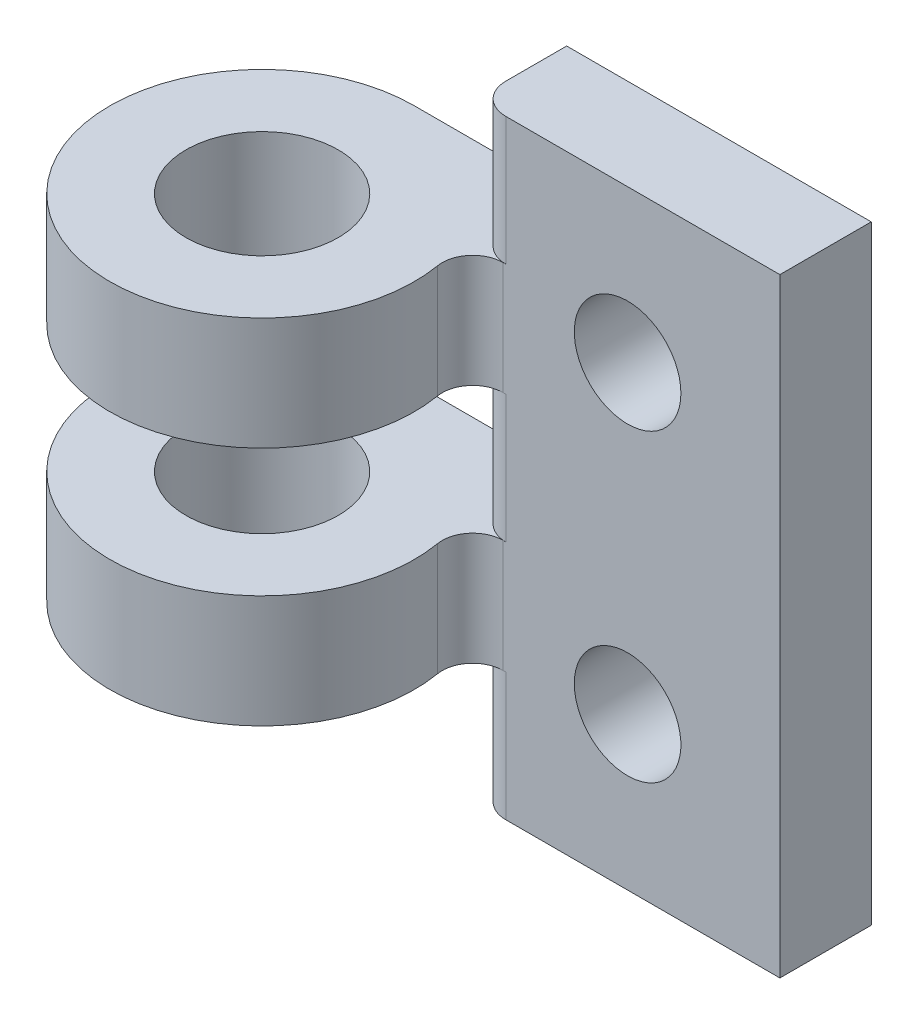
ISO-10303-21;
HEADER;
FILE_DESCRIPTION(('STEP AP214'),'2;1');
FILE_NAME('part.step','',(''),(''),'','','');
FILE_SCHEMA(('AUTOMOTIVE_DESIGN { 1 0 10303 214 1 1 1 1 }'));
ENDSEC;
DATA;
#1=APPLICATION_CONTEXT('core data for automotive mechanical design processes');
#2=APPLICATION_PROTOCOL_DEFINITION('international standard','automotive_design',2000,#1);
#3=PRODUCT_CONTEXT('',#1,'mechanical');
#4=PRODUCT('Part','Part','',(#3));
#5=PRODUCT_RELATED_PRODUCT_CATEGORY('part','',(#4));
#6=PRODUCT_DEFINITION_FORMATION('','',#4);
#7=PRODUCT_DEFINITION_CONTEXT('part definition',#1,'design');
#8=PRODUCT_DEFINITION('design','',#6,#7);
#9=PRODUCT_DEFINITION_SHAPE('','',#8);
#10=(LENGTH_UNIT() NAMED_UNIT(*) SI_UNIT(.MILLI.,.METRE.));
#11=(NAMED_UNIT(*) PLANE_ANGLE_UNIT() SI_UNIT($,.RADIAN.));
#12=(NAMED_UNIT(*) SI_UNIT($,.STERADIAN.) SOLID_ANGLE_UNIT());
#13=UNCERTAINTY_MEASURE_WITH_UNIT(LENGTH_MEASURE(1.E-05),#10,'distance_accuracy_value','');
#14=(GEOMETRIC_REPRESENTATION_CONTEXT(3) GLOBAL_UNCERTAINTY_ASSIGNED_CONTEXT((#13)) GLOBAL_UNIT_ASSIGNED_CONTEXT((#10,
#11,#12)) REPRESENTATION_CONTEXT('',''));
#15=CARTESIAN_POINT('',(0.,0.,0.));
#16=DIRECTION('',(0.,0.,1.));
#17=DIRECTION('',(1.,0.,0.));
#18=AXIS2_PLACEMENT_3D('',#15,#16,#17);
#19=CARTESIAN_POINT('',(-10.,10.,3.5));
#20=DIRECTION('',(0.,-1.,0.));
#21=DIRECTION('',(0.,0.,-1.));
#22=AXIS2_PLACEMENT_3D('',#19,#20,#21);
#23=CYLINDRICAL_SURFACE('',#22,5.);
#24=CARTESIAN_POINT('',(-10.,2.1,3.5));
#25=DIRECTION('',(0.,1.,0.));
#26=DIRECTION('',(0.,0.,1.));
#27=AXIS2_PLACEMENT_3D('',#24,#25,#26);
#28=CIRCLE('',#27,5.);
#29=CARTESIAN_POINT('',(-10.,2.1,-1.5));
#30=VERTEX_POINT('',#29);
#31=CARTESIAN_POINT('',(-5.06993351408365,2.1,2.66666666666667));
#32=VERTEX_POINT('',#31);
#33=EDGE_CURVE('E242',#30,#32,#28,.T.);
#34=ORIENTED_EDGE('',*,*,#33,.T.);
#35=DIRECTION('',(0.,-1.,0.));
#36=VECTOR('',#35,1.);
#37=CARTESIAN_POINT('',(-5.06993351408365,10.,2.66666666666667));
#38=LINE('',#37,#36);
#39=CARTESIAN_POINT('',(-5.06993351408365,5.80000000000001,2.66666666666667));
#40=VERTEX_POINT('',#39);
#41=EDGE_CURVE('E58',#32,#40,#38,.F.);
#42=ORIENTED_EDGE('',*,*,#41,.T.);
#43=CARTESIAN_POINT('',(-10.,5.80000000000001,3.5));
#44=DIRECTION('',(0.,-1.,0.));
#45=DIRECTION('',(1.,0.,0.));
#46=AXIS2_PLACEMENT_3D('',#43,#44,#45);
#47=CIRCLE('',#46,5.);
#48=CARTESIAN_POINT('',(-10.,5.80000000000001,-1.5));
#49=VERTEX_POINT('',#48);
#50=EDGE_CURVE('E244',#40,#49,#47,.T.);
#51=ORIENTED_EDGE('',*,*,#50,.T.);
#52=DIRECTION('',(0.,-1.,0.));
#53=VECTOR('',#52,1.);
#54=CARTESIAN_POINT('',(-10.,10.,-1.5));
#55=LINE('',#54,#53);
#56=EDGE_CURVE('E205',#49,#30,#55,.T.);
#57=ORIENTED_EDGE('',*,*,#56,.T.);
#58=EDGE_LOOP('',(#34,#42,#51,#57));
#59=FACE_BOUND('',#58,.T.);
#60=ADVANCED_FACE('F37',(#59),#23,.T.);
#61=CARTESIAN_POINT('',(0.,0.,1.5));
#62=DIRECTION('',(0.,0.,-1.));
#63=DIRECTION('',(-1.,0.,0.));
#64=AXIS2_PLACEMENT_3D('',#61,#62,#63);
#65=PLANE('',#64);
#66=DIRECTION('',(-1.,0.,0.));
#67=VECTOR('',#66,1.);
#68=CARTESIAN_POINT('',(0.,-2.1,1.5));
#69=LINE('',#68,#67);
#70=CARTESIAN_POINT('',(-4.,-2.1,1.5));
#71=VERTEX_POINT('',#70);
#72=CARTESIAN_POINT('',(-4.08392021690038,-2.1,1.5));
#73=VERTEX_POINT('',#72);
#74=EDGE_CURVE('E182',#71,#73,#69,.T.);
#75=ORIENTED_EDGE('',*,*,#74,.T.);
#76=DIRECTION('',(0.,1.,0.));
#77=VECTOR('',#76,1.);
#78=CARTESIAN_POINT('',(-4.08392021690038,-5.80000000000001,1.5));
#79=LINE('',#78,#77);
#80=CARTESIAN_POINT('',(-4.08392021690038,-5.80000000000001,1.5));
#81=VERTEX_POINT('',#80);
#82=EDGE_CURVE('E285',#73,#81,#79,.F.);
#83=ORIENTED_EDGE('',*,*,#82,.T.);
#84=DIRECTION('',(1.,0.,0.));
#85=VECTOR('',#84,1.);
#86=CARTESIAN_POINT('',(0.,-5.80000000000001,1.5));
#87=LINE('',#86,#85);
#88=CARTESIAN_POINT('',(-4.,-5.80000000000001,1.5));
#89=VERTEX_POINT('',#88);
#90=EDGE_CURVE('E202',#81,#89,#87,.T.);
#91=ORIENTED_EDGE('',*,*,#90,.T.);
#92=DIRECTION('',(0.,-1.,0.));
#93=VECTOR('',#92,1.);
#94=CARTESIAN_POINT('',(-3.99999999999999,0.,1.5));
#95=LINE('',#94,#93);
#96=CARTESIAN_POINT('',(-4.,-10.,1.5));
#97=VERTEX_POINT('',#96);
#98=EDGE_CURVE('E260',#89,#97,#95,.T.);
#99=ORIENTED_EDGE('',*,*,#98,.T.);
#100=DIRECTION('',(1.,0.,0.));
#101=VECTOR('',#100,1.);
#102=CARTESIAN_POINT('',(-5.,-10.,1.5));
#103=LINE('',#102,#101);
#104=CARTESIAN_POINT('',(5.,-10.,1.5));
#105=VERTEX_POINT('',#104);
#106=EDGE_CURVE('E226',#97,#105,#103,.T.);
#107=ORIENTED_EDGE('',*,*,#106,.T.);
#108=DIRECTION('',(0.,1.,0.));
#109=VECTOR('',#108,1.);
#110=CARTESIAN_POINT('',(5.,-10.,1.5));
#111=LINE('',#110,#109);
#112=CARTESIAN_POINT('',(5.,10.,1.5));
#113=VERTEX_POINT('',#112);
#114=EDGE_CURVE('E219',#105,#113,#111,.T.);
#115=ORIENTED_EDGE('',*,*,#114,.T.);
#116=DIRECTION('',(-1.,0.,0.));
#117=VECTOR('',#116,1.);
#118=CARTESIAN_POINT('',(-5.,10.,1.5));
#119=LINE('',#118,#117);
#120=CARTESIAN_POINT('',(-4.,10.,1.5));
#121=VERTEX_POINT('',#120);
#122=EDGE_CURVE('E222',#113,#121,#119,.T.);
#123=ORIENTED_EDGE('',*,*,#122,.T.);
#124=DIRECTION('',(0.,-1.,0.));
#125=VECTOR('',#124,1.);
#126=CARTESIAN_POINT('',(-3.99999999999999,0.,1.5));
#127=LINE('',#126,#125);
#128=CARTESIAN_POINT('',(-4.,5.80000000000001,1.5));
#129=VERTEX_POINT('',#128);
#130=EDGE_CURVE('E249',#121,#129,#127,.T.);
#131=ORIENTED_EDGE('',*,*,#130,.T.);
#132=DIRECTION('',(-1.,0.,0.));
#133=VECTOR('',#132,1.);
#134=CARTESIAN_POINT('',(0.,5.80000000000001,1.5));
#135=LINE('',#134,#133);
#136=CARTESIAN_POINT('',(-4.08392021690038,5.80000000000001,1.5));
#137=VERTEX_POINT('',#136);
#138=EDGE_CURVE('E190',#129,#137,#135,.T.);
#139=ORIENTED_EDGE('',*,*,#138,.T.);
#140=DIRECTION('',(0.,1.,0.));
#141=VECTOR('',#140,1.);
#142=CARTESIAN_POINT('',(-4.08392021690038,2.1,1.5));
#143=LINE('',#142,#141);
#144=CARTESIAN_POINT('',(-4.08392021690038,2.1,1.5));
#145=VERTEX_POINT('',#144);
#146=EDGE_CURVE('E282',#137,#145,#143,.F.);
#147=ORIENTED_EDGE('',*,*,#146,.T.);
#148=DIRECTION('',(1.,0.,0.));
#149=VECTOR('',#148,1.);
#150=CARTESIAN_POINT('',(0.,2.1,1.5));
#151=LINE('',#150,#149);
#152=CARTESIAN_POINT('',(-4.,2.1,1.5));
#153=VERTEX_POINT('',#152);
#154=EDGE_CURVE('E188',#145,#153,#151,.T.);
#155=ORIENTED_EDGE('',*,*,#154,.T.);
#156=DIRECTION('',(0.,-1.,0.));
#157=VECTOR('',#156,1.);
#158=CARTESIAN_POINT('',(-4.,0.,1.5));
#159=LINE('',#158,#157);
#160=EDGE_CURVE('E257',#153,#71,#159,.T.);
#161=ORIENTED_EDGE('',*,*,#160,.T.);
#162=EDGE_LOOP('',(#75,#83,#91,#99,#107,#115,#123,#131,#139,#147,#155,#161));
#163=FACE_BOUND('',#162,.T.);
#164=CARTESIAN_POINT('',(0.,5.,1.5));
#165=DIRECTION('',(0.,0.,1.));
#166=DIRECTION('',(1.,0.,0.));
#167=AXIS2_PLACEMENT_3D('',#164,#165,#166);
#168=CIRCLE('',#167,1.75);
#169=CARTESIAN_POINT('',(1.75,5.,1.5));
#170=VERTEX_POINT('',#169);
#171=EDGE_CURVE('E213',#170,#170,#168,.T.);
#172=ORIENTED_EDGE('',*,*,#171,.F.);
#173=EDGE_LOOP('',(#172));
#174=FACE_BOUND('',#173,.T.);
#175=CARTESIAN_POINT('',(0.,-5.,1.5));
#176=DIRECTION('',(0.,0.,1.));
#177=DIRECTION('',(-1.,0.,0.));
#178=AXIS2_PLACEMENT_3D('',#175,#176,#177);
#179=CIRCLE('',#178,1.75);
#180=CARTESIAN_POINT('',(-1.75,-5.,1.5));
#181=VERTEX_POINT('',#180);
#182=EDGE_CURVE('E206',#181,#181,#179,.T.);
#183=ORIENTED_EDGE('',*,*,#182,.F.);
#184=EDGE_LOOP('',(#183));
#185=FACE_BOUND('',#184,.T.);
#186=ADVANCED_FACE('F299',(#163,#174,#185),#65,.F.);
#187=CARTESIAN_POINT('',(0.,0.,-1.5));
#188=DIRECTION('',(0.,0.,-1.));
#189=DIRECTION('',(-1.,0.,0.));
#190=AXIS2_PLACEMENT_3D('',#187,#188,#189);
#191=PLANE('',#190);
#192=DIRECTION('',(1.,0.,0.));
#193=VECTOR('',#192,1.);
#194=CARTESIAN_POINT('',(0.,-5.80000000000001,-1.5));
#195=LINE('',#194,#193);
#196=CARTESIAN_POINT('',(-10.,-5.80000000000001,-1.5));
#197=VERTEX_POINT('',#196);
#198=CARTESIAN_POINT('',(-5.,-5.80000000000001,-1.5));
#199=VERTEX_POINT('',#198);
#200=EDGE_CURVE('E200',#197,#199,#195,.T.);
#201=ORIENTED_EDGE('',*,*,#200,.F.);
#202=CARTESIAN_POINT('',(-10.,-2.1,-1.5));
#203=VERTEX_POINT('',#202);
#204=EDGE_CURVE('E181',#203,#197,#55,.T.);
#205=ORIENTED_EDGE('',*,*,#204,.F.);
#206=DIRECTION('',(-1.,0.,0.));
#207=VECTOR('',#206,1.);
#208=CARTESIAN_POINT('',(0.,-2.1,-1.5));
#209=LINE('',#208,#207);
#210=CARTESIAN_POINT('',(-5.,-2.1,-1.5));
#211=VERTEX_POINT('',#210);
#212=EDGE_CURVE('E166',#211,#203,#209,.T.);
#213=ORIENTED_EDGE('',*,*,#212,.F.);
#214=DIRECTION('',(0.,-1.,0.));
#215=VECTOR('',#214,1.);
#216=CARTESIAN_POINT('',(-5.,0.,-1.5));
#217=LINE('',#216,#215);
#218=CARTESIAN_POINT('',(-5.,2.1,-1.5));
#219=VERTEX_POINT('',#218);
#220=EDGE_CURVE('E155',#219,#211,#217,.T.);
#221=ORIENTED_EDGE('',*,*,#220,.F.);
#222=DIRECTION('',(1.,0.,0.));
#223=VECTOR('',#222,1.);
#224=CARTESIAN_POINT('',(0.,2.1,-1.5));
#225=LINE('',#224,#223);
#226=EDGE_CURVE('E165',#30,#219,#225,.T.);
#227=ORIENTED_EDGE('',*,*,#226,.F.);
#228=ORIENTED_EDGE('',*,*,#56,.F.);
#229=DIRECTION('',(-1.,0.,0.));
#230=VECTOR('',#229,1.);
#231=CARTESIAN_POINT('',(0.,5.80000000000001,-1.5));
#232=LINE('',#231,#230);
#233=CARTESIAN_POINT('',(-5.,5.80000000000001,-1.5));
#234=VERTEX_POINT('',#233);
#235=EDGE_CURVE('E193',#234,#49,#232,.T.);
#236=ORIENTED_EDGE('',*,*,#235,.F.);
#237=DIRECTION('',(0.,-1.,0.));
#238=VECTOR('',#237,1.);
#239=CARTESIAN_POINT('',(-4.99999999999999,0.,-1.5));
#240=LINE('',#239,#238);
#241=CARTESIAN_POINT('',(-5.,10.,-1.5));
#242=VERTEX_POINT('',#241);
#243=EDGE_CURVE('E196',#242,#234,#240,.T.);
#244=ORIENTED_EDGE('',*,*,#243,.F.);
#245=DIRECTION('',(-1.,0.,0.));
#246=VECTOR('',#245,1.);
#247=CARTESIAN_POINT('',(-5.,10.,-1.5));
#248=LINE('',#247,#246);
#249=CARTESIAN_POINT('',(5.,10.,-1.5));
#250=VERTEX_POINT('',#249);
#251=EDGE_CURVE('E231',#250,#242,#248,.T.);
#252=ORIENTED_EDGE('',*,*,#251,.F.);
#253=DIRECTION('',(0.,1.,0.));
#254=VECTOR('',#253,1.);
#255=CARTESIAN_POINT('',(5.,-10.,-1.5));
#256=LINE('',#255,#254);
#257=CARTESIAN_POINT('',(5.,-10.,-1.5));
#258=VERTEX_POINT('',#257);
#259=EDGE_CURVE('E216',#258,#250,#256,.T.);
#260=ORIENTED_EDGE('',*,*,#259,.F.);
#261=DIRECTION('',(1.,0.,0.));
#262=VECTOR('',#261,1.);
#263=CARTESIAN_POINT('',(-5.,-10.,-1.5));
#264=LINE('',#263,#262);
#265=CARTESIAN_POINT('',(-5.,-10.,-1.5));
#266=VERTEX_POINT('',#265);
#267=EDGE_CURVE('E223',#266,#258,#264,.T.);
#268=ORIENTED_EDGE('',*,*,#267,.F.);
#269=DIRECTION('',(0.,-1.,0.));
#270=VECTOR('',#269,1.);
#271=CARTESIAN_POINT('',(-4.99999999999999,0.,-1.5));
#272=LINE('',#271,#270);
#273=EDGE_CURVE('E198',#199,#266,#272,.T.);
#274=ORIENTED_EDGE('',*,*,#273,.F.);
#275=EDGE_LOOP('',(#201,#205,#213,#221,#227,#228,#236,#244,#252,#260,#268,#274));
#276=FACE_BOUND('',#275,.T.);
#277=CARTESIAN_POINT('',(0.,5.,-1.5));
#278=DIRECTION('',(0.,0.,1.));
#279=DIRECTION('',(1.,0.,0.));
#280=AXIS2_PLACEMENT_3D('',#277,#278,#279);
#281=CIRCLE('',#280,1.75);
#282=CARTESIAN_POINT('',(1.75,5.,-1.5));
#283=VERTEX_POINT('',#282);
#284=EDGE_CURVE('E209',#283,#283,#281,.T.);
#285=ORIENTED_EDGE('',*,*,#284,.T.);
#286=EDGE_LOOP('',(#285));
#287=FACE_BOUND('',#286,.T.);
#288=CARTESIAN_POINT('',(0.,-5.,-1.5));
#289=DIRECTION('',(0.,0.,1.));
#290=DIRECTION('',(-1.,0.,0.));
#291=AXIS2_PLACEMENT_3D('',#288,#289,#290);
#292=CIRCLE('',#291,1.75);
#293=CARTESIAN_POINT('',(-1.75,-5.,-1.5));
#294=VERTEX_POINT('',#293);
#295=EDGE_CURVE('E210',#294,#294,#292,.T.);
#296=ORIENTED_EDGE('',*,*,#295,.T.);
#297=EDGE_LOOP('',(#296));
#298=FACE_BOUND('',#297,.T.);
#299=ADVANCED_FACE('F178',(#276,#287,#298),#191,.T.);
#300=CARTESIAN_POINT('',(5.,-10.,1.5));
#301=DIRECTION('',(-1.,0.,0.));
#302=DIRECTION('',(0.,-1.,0.));
#303=AXIS2_PLACEMENT_3D('',#300,#301,#302);
#304=PLANE('',#303);
#305=ORIENTED_EDGE('',*,*,#259,.T.);
#306=DIRECTION('',(0.,0.,-1.));
#307=VECTOR('',#306,1.);
#308=CARTESIAN_POINT('',(5.,10.,1.5));
#309=LINE('',#308,#307);
#310=EDGE_CURVE('E237',#113,#250,#309,.T.);
#311=ORIENTED_EDGE('',*,*,#310,.F.);
#312=ORIENTED_EDGE('',*,*,#114,.F.);
#313=DIRECTION('',(0.,0.,-1.));
#314=VECTOR('',#313,1.);
#315=CARTESIAN_POINT('',(5.,-10.,1.5));
#316=LINE('',#315,#314);
#317=EDGE_CURVE('E228',#105,#258,#316,.T.);
#318=ORIENTED_EDGE('',*,*,#317,.T.);
#319=EDGE_LOOP('',(#305,#311,#312,#318));
#320=FACE_BOUND('',#319,.T.);
#321=ADVANCED_FACE('F551',(#320),#304,.F.);
#322=CARTESIAN_POINT('',(-5.,10.,1.5));
#323=DIRECTION('',(0.,-1.,0.));
#324=DIRECTION('',(1.,0.,0.));
#325=AXIS2_PLACEMENT_3D('',#322,#323,#324);
#326=PLANE('',#325);
#327=DIRECTION('',(0.,0.,1.));
#328=VECTOR('',#327,1.);
#329=CARTESIAN_POINT('',(-5.,10.,-8.50000000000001));
#330=LINE('',#329,#328);
#331=CARTESIAN_POINT('',(-5.,10.,0.5));
#332=VERTEX_POINT('',#331);
#333=EDGE_CURVE('E348',#242,#332,#330,.T.);
#334=ORIENTED_EDGE('',*,*,#333,.T.);
#335=CARTESIAN_POINT('',(-4.,10.,0.5));
#336=DIRECTION('',(0.,-1.,0.));
#337=DIRECTION('',(1.,0.,0.));
#338=AXIS2_PLACEMENT_3D('',#335,#336,#337);
#339=CIRCLE('',#338,1.);
#340=EDGE_CURVE('E271',#332,#121,#339,.F.);
#341=ORIENTED_EDGE('',*,*,#340,.T.);
#342=ORIENTED_EDGE('',*,*,#122,.F.);
#343=ORIENTED_EDGE('',*,*,#310,.T.);
#344=ORIENTED_EDGE('',*,*,#251,.T.);
#345=EDGE_LOOP('',(#334,#341,#342,#343,#344));
#346=FACE_BOUND('',#345,.T.);
#347=ADVANCED_FACE('F542',(#346),#326,.F.);
#348=CARTESIAN_POINT('',(-5.,-10.,1.5));
#349=DIRECTION('',(0.,1.,0.));
#350=DIRECTION('',(0.,0.,1.));
#351=AXIS2_PLACEMENT_3D('',#348,#349,#350);
#352=PLANE('',#351);
#353=ORIENTED_EDGE('',*,*,#106,.F.);
#354=CARTESIAN_POINT('',(-4.,-10.,0.5));
#355=DIRECTION('',(0.,1.,0.));
#356=DIRECTION('',(0.,0.,1.));
#357=AXIS2_PLACEMENT_3D('',#354,#355,#356);
#358=CIRCLE('',#357,1.);
#359=CARTESIAN_POINT('',(-5.,-10.,0.5));
#360=VERTEX_POINT('',#359);
#361=EDGE_CURVE('E263',#97,#360,#358,.F.);
#362=ORIENTED_EDGE('',*,*,#361,.T.);
#363=DIRECTION('',(0.,0.,1.));
#364=VECTOR('',#363,1.);
#365=CARTESIAN_POINT('',(-5.,-10.,-8.50000000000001));
#366=LINE('',#365,#364);
#367=EDGE_CURVE('E350',#266,#360,#366,.T.);
#368=ORIENTED_EDGE('',*,*,#367,.F.);
#369=ORIENTED_EDGE('',*,*,#267,.T.);
#370=ORIENTED_EDGE('',*,*,#317,.F.);
#371=EDGE_LOOP('',(#353,#362,#368,#369,#370));
#372=FACE_BOUND('',#371,.T.);
#373=ADVANCED_FACE('F437',(#372),#352,.F.);
#374=CARTESIAN_POINT('',(0.,5.,1.5));
#375=DIRECTION('',(0.,0.,-1.));
#376=DIRECTION('',(-1.,0.,0.));
#377=AXIS2_PLACEMENT_3D('',#374,#375,#376);
#378=CYLINDRICAL_SURFACE('',#377,1.75);
#379=ORIENTED_EDGE('',*,*,#171,.T.);
#380=EDGE_LOOP('',(#379));
#381=FACE_BOUND('',#380,.T.);
#382=ORIENTED_EDGE('',*,*,#284,.F.);
#383=EDGE_LOOP('',(#382));
#384=FACE_BOUND('',#383,.T.);
#385=ADVANCED_FACE('F319',(#381,#384),#378,.F.);
#386=CARTESIAN_POINT('',(0.,-5.,1.5));
#387=DIRECTION('',(0.,0.,-1.));
#388=DIRECTION('',(-1.,0.,0.));
#389=AXIS2_PLACEMENT_3D('',#386,#387,#388);
#390=CYLINDRICAL_SURFACE('',#389,1.75);
#391=ORIENTED_EDGE('',*,*,#182,.T.);
#392=EDGE_LOOP('',(#391));
#393=FACE_BOUND('',#392,.T.);
#394=ORIENTED_EDGE('',*,*,#295,.F.);
#395=EDGE_LOOP('',(#394));
#396=FACE_BOUND('',#395,.T.);
#397=ADVANCED_FACE('F310',(#393,#396),#390,.F.);
#398=CARTESIAN_POINT('',(-10.,-5.80000000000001,3.5));
#399=DIRECTION('',(0.,1.,0.));
#400=DIRECTION('',(-1.,0.,0.));
#401=AXIS2_PLACEMENT_3D('',#398,#399,#400);
#402=CIRCLE('',#401,5.);
#403=CARTESIAN_POINT('',(-5.06993351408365,-5.80000000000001,2.66666666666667));
#404=VERTEX_POINT('',#403);
#405=EDGE_CURVE('E246',#197,#404,#402,.T.);
#406=ORIENTED_EDGE('',*,*,#405,.T.);
#407=DIRECTION('',(0.,-1.,0.));
#408=VECTOR('',#407,1.);
#409=CARTESIAN_POINT('',(-5.06993351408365,10.,2.66666666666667));
#410=LINE('',#409,#408);
#411=CARTESIAN_POINT('',(-5.06993351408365,-2.1,2.66666666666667));
#412=VERTEX_POINT('',#411);
#413=EDGE_CURVE('E288',#404,#412,#410,.F.);
#414=ORIENTED_EDGE('',*,*,#413,.T.);
#415=CARTESIAN_POINT('',(-10.,-2.1,3.5));
#416=DIRECTION('',(0.,-1.,0.));
#417=DIRECTION('',(0.,0.,-1.));
#418=AXIS2_PLACEMENT_3D('',#415,#416,#417);
#419=CIRCLE('',#418,5.);
#420=EDGE_CURVE('E240',#412,#203,#419,.T.);
#421=ORIENTED_EDGE('',*,*,#420,.T.);
#422=ORIENTED_EDGE('',*,*,#204,.T.);
#423=EDGE_LOOP('',(#406,#414,#421,#422));
#424=FACE_BOUND('',#423,.T.);
#425=ADVANCED_FACE('F307',(#424),#23,.T.);
#426=CARTESIAN_POINT('',(-15.,2.1,-8.50000000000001));
#427=DIRECTION('',(0.,1.,0.));
#428=DIRECTION('',(0.,0.,1.));
#429=AXIS2_PLACEMENT_3D('',#426,#427,#428);
#430=PLANE('',#429);
#431=CARTESIAN_POINT('',(-10.,2.1,3.5));
#432=DIRECTION('',(0.,1.,0.));
#433=DIRECTION('',(0.,0.,1.));
#434=AXIS2_PLACEMENT_3D('',#431,#432,#433);
#435=CIRCLE('',#434,2.5);
#436=CARTESIAN_POINT('',(-10.,2.1,6.00000000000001));
#437=VERTEX_POINT('',#436);
#438=EDGE_CURVE('E353',#437,#437,#435,.T.);
#439=ORIENTED_EDGE('',*,*,#438,.T.);
#440=EDGE_LOOP('',(#439));
#441=FACE_BOUND('',#440,.T.);
#442=ORIENTED_EDGE('',*,*,#154,.F.);
#443=CARTESIAN_POINT('',(-4.08392021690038,2.1,2.5));
#444=DIRECTION('',(0.,1.,0.));
#445=DIRECTION('',(0.,0.,1.));
#446=AXIS2_PLACEMENT_3D('',#443,#444,#445);
#447=CIRCLE('',#446,1.);
#448=EDGE_CURVE('E45',#145,#32,#447,.T.);
#449=ORIENTED_EDGE('',*,*,#448,.T.);
#450=ORIENTED_EDGE('',*,*,#33,.F.);
#451=ORIENTED_EDGE('',*,*,#226,.T.);
#452=DIRECTION('',(0.,0.,1.));
#453=VECTOR('',#452,1.);
#454=CARTESIAN_POINT('',(-5.,2.1,-8.50000000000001));
#455=LINE('',#454,#453);
#456=CARTESIAN_POINT('',(-5.,2.1,0.5));
#457=VERTEX_POINT('',#456);
#458=EDGE_CURVE('E161',#219,#457,#455,.T.);
#459=ORIENTED_EDGE('',*,*,#458,.T.);
#460=CARTESIAN_POINT('',(-4.,2.1,0.5));
#461=DIRECTION('',(0.,1.,0.));
#462=DIRECTION('',(0.,0.,1.));
#463=AXIS2_PLACEMENT_3D('',#460,#461,#462);
#464=CIRCLE('',#463,1.);
#465=EDGE_CURVE('E277',#457,#153,#464,.T.);
#466=ORIENTED_EDGE('',*,*,#465,.T.);
#467=EDGE_LOOP('',(#442,#449,#450,#451,#459,#466));
#468=FACE_BOUND('',#467,.T.);
#469=ADVANCED_FACE('F309',(#441,#468),#430,.F.);
#470=CARTESIAN_POINT('',(-5.,2.1,-8.50000000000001));
#471=DIRECTION('',(1.,0.,0.));
#472=DIRECTION('',(0.,0.,-1.));
#473=AXIS2_PLACEMENT_3D('',#470,#471,#472);
#474=PLANE('',#473);
#475=DIRECTION('',(0.,0.,1.));
#476=VECTOR('',#475,1.);
#477=CARTESIAN_POINT('',(-5.,-2.1,-8.50000000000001));
#478=LINE('',#477,#476);
#479=CARTESIAN_POINT('',(-5.,-2.1,0.5));
#480=VERTEX_POINT('',#479);
#481=EDGE_CURVE('E158',#211,#480,#478,.T.);
#482=ORIENTED_EDGE('',*,*,#481,.T.);
#483=DIRECTION('',(0.,-1.,0.));
#484=VECTOR('',#483,1.);
#485=CARTESIAN_POINT('',(-5.,2.1,0.5));
#486=LINE('',#485,#484);
#487=EDGE_CURVE('E267',#480,#457,#486,.F.);
#488=ORIENTED_EDGE('',*,*,#487,.T.);
#489=ORIENTED_EDGE('',*,*,#458,.F.);
#490=ORIENTED_EDGE('',*,*,#220,.T.);
#491=EDGE_LOOP('',(#482,#488,#489,#490));
#492=FACE_BOUND('',#491,.T.);
#493=ADVANCED_FACE('F157',(#492),#474,.F.);
#494=CARTESIAN_POINT('',(-15.,-2.1,-8.50000000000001));
#495=DIRECTION('',(0.,-1.,0.));
#496=DIRECTION('',(0.,0.,-1.));
#497=AXIS2_PLACEMENT_3D('',#494,#495,#496);
#498=PLANE('',#497);
#499=CARTESIAN_POINT('',(-10.,-2.1,3.5));
#500=DIRECTION('',(0.,-1.,0.));
#501=DIRECTION('',(0.,0.,-1.));
#502=AXIS2_PLACEMENT_3D('',#499,#500,#501);
#503=CIRCLE('',#502,2.5);
#504=CARTESIAN_POINT('',(-10.,-2.1,1.));
#505=VERTEX_POINT('',#504);
#506=EDGE_CURVE('E253',#505,#505,#503,.T.);
#507=ORIENTED_EDGE('',*,*,#506,.T.);
#508=EDGE_LOOP('',(#507));
#509=FACE_BOUND('',#508,.T.);
#510=ORIENTED_EDGE('',*,*,#212,.T.);
#511=ORIENTED_EDGE('',*,*,#420,.F.);
#512=CARTESIAN_POINT('',(-4.08392021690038,-2.1,2.5));
#513=DIRECTION('',(0.,-1.,0.));
#514=DIRECTION('',(0.,0.,-1.));
#515=AXIS2_PLACEMENT_3D('',#512,#513,#514);
#516=CIRCLE('',#515,1.);
#517=EDGE_CURVE('E293',#412,#73,#516,.T.);
#518=ORIENTED_EDGE('',*,*,#517,.T.);
#519=ORIENTED_EDGE('',*,*,#74,.F.);
#520=CARTESIAN_POINT('',(-4.,-2.1,0.5));
#521=DIRECTION('',(0.,-1.,0.));
#522=DIRECTION('',(0.,0.,-1.));
#523=AXIS2_PLACEMENT_3D('',#520,#521,#522);
#524=CIRCLE('',#523,1.);
#525=EDGE_CURVE('E174',#71,#480,#524,.T.);
#526=ORIENTED_EDGE('',*,*,#525,.T.);
#527=ORIENTED_EDGE('',*,*,#481,.F.);
#528=EDGE_LOOP('',(#510,#511,#518,#519,#526,#527));
#529=FACE_BOUND('',#528,.T.);
#530=ADVANCED_FACE('F170',(#509,#529),#498,.F.);
#531=CARTESIAN_POINT('',(-5.,10.,-8.50000000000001));
#532=DIRECTION('',(1.,0.,0.));
#533=DIRECTION('',(0.,1.,0.));
#534=AXIS2_PLACEMENT_3D('',#531,#532,#533);
#535=PLANE('',#534);
#536=DIRECTION('',(0.,0.,1.));
#537=VECTOR('',#536,1.);
#538=CARTESIAN_POINT('',(-5.,5.80000000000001,-8.50000000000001));
#539=LINE('',#538,#537);
#540=CARTESIAN_POINT('',(-5.,5.80000000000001,0.5));
#541=VERTEX_POINT('',#540);
#542=EDGE_CURVE('E175',#234,#541,#539,.T.);
#543=ORIENTED_EDGE('',*,*,#542,.T.);
#544=DIRECTION('',(0.,-1.,0.));
#545=VECTOR('',#544,1.);
#546=CARTESIAN_POINT('',(-5.,10.,0.5));
#547=LINE('',#546,#545);
#548=EDGE_CURVE('E269',#541,#332,#547,.F.);
#549=ORIENTED_EDGE('',*,*,#548,.T.);
#550=ORIENTED_EDGE('',*,*,#333,.F.);
#551=ORIENTED_EDGE('',*,*,#243,.T.);
#552=EDGE_LOOP('',(#543,#549,#550,#551));
#553=FACE_BOUND('',#552,.T.);
#554=ADVANCED_FACE('F345',(#553),#535,.F.);
#555=CARTESIAN_POINT('',(-15.,5.80000000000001,-8.50000000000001));
#556=DIRECTION('',(0.,-1.,0.));
#557=DIRECTION('',(1.,0.,0.));
#558=AXIS2_PLACEMENT_3D('',#555,#556,#557);
#559=PLANE('',#558);
#560=CARTESIAN_POINT('',(-10.,5.80000000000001,3.5));
#561=DIRECTION('',(0.,1.,0.));
#562=DIRECTION('',(0.,0.,1.));
#563=AXIS2_PLACEMENT_3D('',#560,#561,#562);
#564=CIRCLE('',#563,2.5);
#565=CARTESIAN_POINT('',(-10.,5.80000000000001,6.00000000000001));
#566=VERTEX_POINT('',#565);
#567=EDGE_CURVE('E254',#566,#566,#564,.T.);
#568=ORIENTED_EDGE('',*,*,#567,.F.);
#569=EDGE_LOOP('',(#568));
#570=FACE_BOUND('',#569,.T.);
#571=ORIENTED_EDGE('',*,*,#235,.T.);
#572=ORIENTED_EDGE('',*,*,#50,.F.);
#573=CARTESIAN_POINT('',(-4.08392021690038,5.80000000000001,2.5));
#574=DIRECTION('',(0.,-1.,0.));
#575=DIRECTION('',(1.,0.,0.));
#576=AXIS2_PLACEMENT_3D('',#573,#574,#575);
#577=CIRCLE('',#576,1.);
#578=EDGE_CURVE('E11',#40,#137,#577,.T.);
#579=ORIENTED_EDGE('',*,*,#578,.T.);
#580=ORIENTED_EDGE('',*,*,#138,.F.);
#581=CARTESIAN_POINT('',(-4.,5.80000000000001,0.5));
#582=DIRECTION('',(0.,-1.,0.));
#583=DIRECTION('',(1.,0.,0.));
#584=AXIS2_PLACEMENT_3D('',#581,#582,#583);
#585=CIRCLE('',#584,1.);
#586=EDGE_CURVE('E280',#129,#541,#585,.T.);
#587=ORIENTED_EDGE('',*,*,#586,.T.);
#588=ORIENTED_EDGE('',*,*,#542,.F.);
#589=EDGE_LOOP('',(#571,#572,#579,#580,#587,#588));
#590=FACE_BOUND('',#589,.T.);
#591=ADVANCED_FACE('F334',(#570,#590),#559,.F.);
#592=CARTESIAN_POINT('',(-15.,-5.80000000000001,-8.50000000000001));
#593=DIRECTION('',(0.,1.,0.));
#594=DIRECTION('',(-1.,0.,0.));
#595=AXIS2_PLACEMENT_3D('',#592,#593,#594);
#596=PLANE('',#595);
#597=CARTESIAN_POINT('',(-10.,-5.80000000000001,3.5));
#598=DIRECTION('',(0.,1.,0.));
#599=DIRECTION('',(-1.,0.,0.));
#600=AXIS2_PLACEMENT_3D('',#597,#598,#599);
#601=CIRCLE('',#600,2.5);
#602=CARTESIAN_POINT('',(-12.5,-5.80000000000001,3.5));
#603=VERTEX_POINT('',#602);
#604=EDGE_CURVE('E250',#603,#603,#601,.T.);
#605=ORIENTED_EDGE('',*,*,#604,.T.);
#606=EDGE_LOOP('',(#605));
#607=FACE_BOUND('',#606,.T.);
#608=ORIENTED_EDGE('',*,*,#405,.F.);
#609=ORIENTED_EDGE('',*,*,#200,.T.);
#610=DIRECTION('',(0.,0.,1.));
#611=VECTOR('',#610,1.);
#612=CARTESIAN_POINT('',(-5.,-5.80000000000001,-8.50000000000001));
#613=LINE('',#612,#611);
#614=CARTESIAN_POINT('',(-5.,-5.80000000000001,0.5));
#615=VERTEX_POINT('',#614);
#616=EDGE_CURVE('E358',#199,#615,#613,.T.);
#617=ORIENTED_EDGE('',*,*,#616,.T.);
#618=CARTESIAN_POINT('',(-4.,-5.80000000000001,0.5));
#619=DIRECTION('',(0.,1.,0.));
#620=DIRECTION('',(-1.,0.,0.));
#621=AXIS2_PLACEMENT_3D('',#618,#619,#620);
#622=CIRCLE('',#621,1.);
#623=EDGE_CURVE('E273',#615,#89,#622,.T.);
#624=ORIENTED_EDGE('',*,*,#623,.T.);
#625=ORIENTED_EDGE('',*,*,#90,.F.);
#626=CARTESIAN_POINT('',(-4.08392021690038,-5.80000000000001,2.5));
#627=DIRECTION('',(0.,1.,0.));
#628=DIRECTION('',(-1.,0.,0.));
#629=AXIS2_PLACEMENT_3D('',#626,#627,#628);
#630=CIRCLE('',#629,1.);
#631=EDGE_CURVE('E291',#81,#404,#630,.T.);
#632=ORIENTED_EDGE('',*,*,#631,.T.);
#633=EDGE_LOOP('',(#608,#609,#617,#624,#625,#632));
#634=FACE_BOUND('',#633,.T.);
#635=ADVANCED_FACE('F305',(#607,#634),#596,.F.);
#636=CARTESIAN_POINT('',(-5.,-10.,-8.50000000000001));
#637=DIRECTION('',(1.,0.,0.));
#638=DIRECTION('',(0.,1.,0.));
#639=AXIS2_PLACEMENT_3D('',#636,#637,#638);
#640=PLANE('',#639);
#641=ORIENTED_EDGE('',*,*,#367,.T.);
#642=DIRECTION('',(0.,-1.,0.));
#643=VECTOR('',#642,1.);
#644=CARTESIAN_POINT('',(-5.,-10.,0.5));
#645=LINE('',#644,#643);
#646=EDGE_CURVE('E265',#360,#615,#645,.F.);
#647=ORIENTED_EDGE('',*,*,#646,.T.);
#648=ORIENTED_EDGE('',*,*,#616,.F.);
#649=ORIENTED_EDGE('',*,*,#273,.T.);
#650=EDGE_LOOP('',(#641,#647,#648,#649));
#651=FACE_BOUND('',#650,.T.);
#652=ADVANCED_FACE('F397',(#651),#640,.F.);
#653=CARTESIAN_POINT('',(-10.,-14.2,3.5));
#654=DIRECTION('',(0.,1.,0.));
#655=DIRECTION('',(0.,0.,1.));
#656=AXIS2_PLACEMENT_3D('',#653,#654,#655);
#657=CYLINDRICAL_SURFACE('',#656,2.5);
#658=ORIENTED_EDGE('',*,*,#604,.F.);
#659=EDGE_LOOP('',(#658));
#660=FACE_BOUND('',#659,.T.);
#661=ORIENTED_EDGE('',*,*,#506,.F.);
#662=EDGE_LOOP('',(#661));
#663=FACE_BOUND('',#662,.T.);
#664=ADVANCED_FACE('F453',(#660,#663),#657,.F.);
#665=ORIENTED_EDGE('',*,*,#567,.T.);
#666=EDGE_LOOP('',(#665));
#667=FACE_BOUND('',#666,.T.);
#668=ORIENTED_EDGE('',*,*,#438,.F.);
#669=EDGE_LOOP('',(#668));
#670=FACE_BOUND('',#669,.T.);
#671=ADVANCED_FACE('F372',(#667,#670),#657,.F.);
#672=CARTESIAN_POINT('',(-3.99999999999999,0.,0.5));
#673=DIRECTION('',(0.,-1.,0.));
#674=DIRECTION('',(1.,0.,0.));
#675=AXIS2_PLACEMENT_3D('',#672,#673,#674);
#676=CYLINDRICAL_SURFACE('',#675,1.);
#677=ORIENTED_EDGE('',*,*,#623,.F.);
#678=ORIENTED_EDGE('',*,*,#646,.F.);
#679=ORIENTED_EDGE('',*,*,#361,.F.);
#680=ORIENTED_EDGE('',*,*,#98,.F.);
#681=EDGE_LOOP('',(#677,#678,#679,#680));
#682=FACE_BOUND('',#681,.T.);
#683=ADVANCED_FACE('F365',(#682),#676,.T.);
#684=CARTESIAN_POINT('',(-4.,0.,0.5));
#685=DIRECTION('',(0.,-1.,0.));
#686=DIRECTION('',(0.,0.,-1.));
#687=AXIS2_PLACEMENT_3D('',#684,#685,#686);
#688=CYLINDRICAL_SURFACE('',#687,1.);
#689=ORIENTED_EDGE('',*,*,#465,.F.);
#690=ORIENTED_EDGE('',*,*,#487,.F.);
#691=ORIENTED_EDGE('',*,*,#525,.F.);
#692=ORIENTED_EDGE('',*,*,#160,.F.);
#693=EDGE_LOOP('',(#689,#690,#691,#692));
#694=FACE_BOUND('',#693,.T.);
#695=ADVANCED_FACE('F363',(#694),#688,.T.);
#696=CARTESIAN_POINT('',(-3.99999999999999,0.,0.5));
#697=DIRECTION('',(0.,-1.,0.));
#698=DIRECTION('',(1.,0.,0.));
#699=AXIS2_PLACEMENT_3D('',#696,#697,#698);
#700=CYLINDRICAL_SURFACE('',#699,1.);
#701=ORIENTED_EDGE('',*,*,#340,.F.);
#702=ORIENTED_EDGE('',*,*,#548,.F.);
#703=ORIENTED_EDGE('',*,*,#586,.F.);
#704=ORIENTED_EDGE('',*,*,#130,.F.);
#705=EDGE_LOOP('',(#701,#702,#703,#704));
#706=FACE_BOUND('',#705,.T.);
#707=ADVANCED_FACE('F339',(#706),#700,.T.);
#708=CARTESIAN_POINT('',(-4.08392021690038,10.,2.5));
#709=DIRECTION('',(0.,-1.,0.));
#710=DIRECTION('',(0.,0.,-1.));
#711=AXIS2_PLACEMENT_3D('',#708,#709,#710);
#712=CYLINDRICAL_SURFACE('',#711,1.);
#713=ORIENTED_EDGE('',*,*,#517,.F.);
#714=ORIENTED_EDGE('',*,*,#413,.F.);
#715=ORIENTED_EDGE('',*,*,#631,.F.);
#716=ORIENTED_EDGE('',*,*,#82,.F.);
#717=EDGE_LOOP('',(#713,#714,#715,#716));
#718=FACE_BOUND('',#717,.T.);
#719=ADVANCED_FACE('F303',(#718),#712,.F.);
#720=CARTESIAN_POINT('',(-4.08392021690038,10.,2.5));
#721=DIRECTION('',(0.,-1.,0.));
#722=DIRECTION('',(0.,0.,-1.));
#723=AXIS2_PLACEMENT_3D('',#720,#721,#722);
#724=CYLINDRICAL_SURFACE('',#723,1.);
#725=ORIENTED_EDGE('',*,*,#578,.F.);
#726=ORIENTED_EDGE('',*,*,#41,.F.);
#727=ORIENTED_EDGE('',*,*,#448,.F.);
#728=ORIENTED_EDGE('',*,*,#146,.F.);
#729=EDGE_LOOP('',(#725,#726,#727,#728));
#730=FACE_BOUND('',#729,.T.);
#731=ADVANCED_FACE('F39',(#730),#724,.F.);
#732=CLOSED_SHELL('',(#60,#186,#299,#321,#347,#373,#385,#397,#425,#469,#493,#530,#554,#591,#635,
#652,#664,#671,#683,#695,#707,#719,#731));
#733=MANIFOLD_SOLID_BREP('B2',#732);
#734=ADVANCED_BREP_SHAPE_REPRESENTATION('',(#18,#733),#14);
#735=SHAPE_DEFINITION_REPRESENTATION(#9,#734);
ENDSEC;
END-ISO-10303-21;
